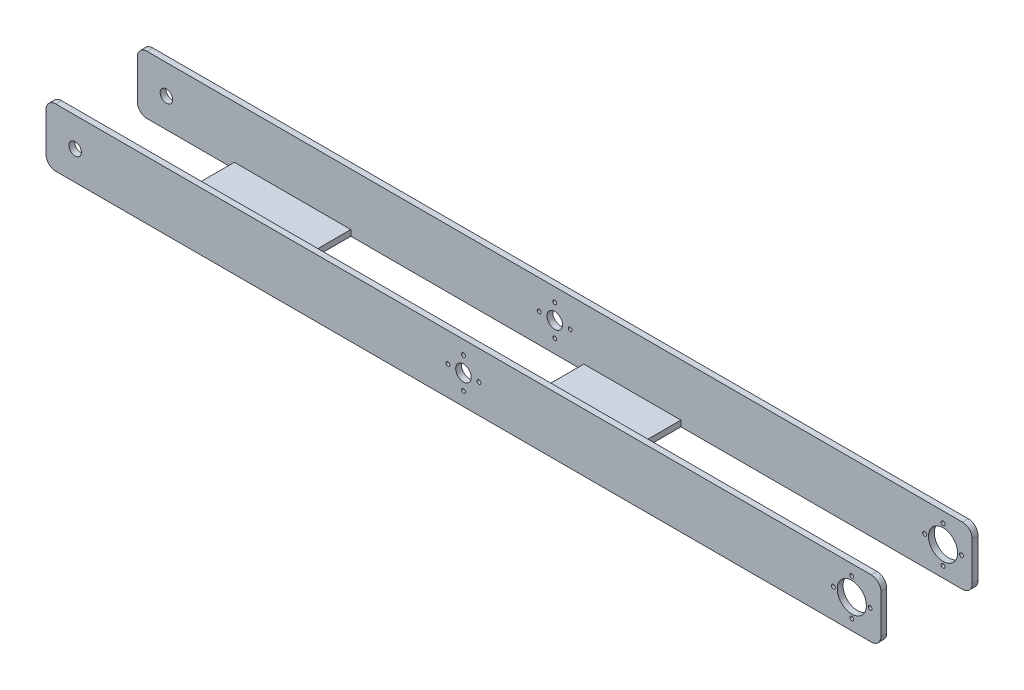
ISO-10303-21;
HEADER;
FILE_DESCRIPTION(('STEP AP214'),'2;1');
FILE_NAME('part.step','',(''),(''),'','','');
FILE_SCHEMA(('AUTOMOTIVE_DESIGN { 1 0 10303 214 1 1 1 1 }'));
ENDSEC;
DATA;
#1=APPLICATION_CONTEXT('core data for automotive mechanical design processes');
#2=APPLICATION_PROTOCOL_DEFINITION('international standard','automotive_design',2000,#1);
#3=PRODUCT_CONTEXT('',#1,'mechanical');
#4=PRODUCT('Part','Part','',(#3));
#5=PRODUCT_RELATED_PRODUCT_CATEGORY('part','',(#4));
#6=PRODUCT_DEFINITION_FORMATION('','',#4);
#7=PRODUCT_DEFINITION_CONTEXT('part definition',#1,'design');
#8=PRODUCT_DEFINITION('design','',#6,#7);
#9=PRODUCT_DEFINITION_SHAPE('','',#8);
#10=(LENGTH_UNIT() NAMED_UNIT(*) SI_UNIT(.MILLI.,.METRE.));
#11=(NAMED_UNIT(*) PLANE_ANGLE_UNIT() SI_UNIT($,.RADIAN.));
#12=(NAMED_UNIT(*) SI_UNIT($,.STERADIAN.) SOLID_ANGLE_UNIT());
#13=UNCERTAINTY_MEASURE_WITH_UNIT(LENGTH_MEASURE(1.E-05),#10,'distance_accuracy_value','');
#14=(GEOMETRIC_REPRESENTATION_CONTEXT(3) GLOBAL_UNCERTAINTY_ASSIGNED_CONTEXT((#13)) GLOBAL_UNIT_ASSIGNED_CONTEXT((#10,
#11,#12)) REPRESENTATION_CONTEXT('',''));
#15=CARTESIAN_POINT('',(0.,0.,0.));
#16=DIRECTION('',(0.,0.,1.));
#17=DIRECTION('',(1.,0.,0.));
#18=AXIS2_PLACEMENT_3D('',#15,#16,#17);
#19=CARTESIAN_POINT('',(215.,-15.,50.));
#20=DIRECTION('',(-1.,0.,0.));
#21=DIRECTION('',(0.,0.,1.));
#22=AXIS2_PLACEMENT_3D('',#19,#20,#21);
#23=PLANE('',#22);
#24=DIRECTION('',(0.,1.,0.));
#25=VECTOR('',#24,1.);
#26=CARTESIAN_POINT('',(215.,-15.,50.));
#27=LINE('',#26,#25);
#28=CARTESIAN_POINT('',(215.,-10.,50.));
#29=VERTEX_POINT('',#28);
#30=CARTESIAN_POINT('',(215.,10.,50.));
#31=VERTEX_POINT('',#30);
#32=EDGE_CURVE('E267',#29,#31,#27,.T.);
#33=ORIENTED_EDGE('',*,*,#32,.F.);
#34=DIRECTION('',(0.,0.,-1.));
#35=VECTOR('',#34,1.);
#36=CARTESIAN_POINT('',(215.,-10.,50.));
#37=LINE('',#36,#35);
#38=CARTESIAN_POINT('',(215.,-10.,47.));
#39=VERTEX_POINT('',#38);
#40=EDGE_CURVE('E392',#29,#39,#37,.T.);
#41=ORIENTED_EDGE('',*,*,#40,.T.);
#42=DIRECTION('',(0.,1.,0.));
#43=VECTOR('',#42,1.);
#44=CARTESIAN_POINT('',(215.,0.,47.));
#45=LINE('',#44,#43);
#46=CARTESIAN_POINT('',(215.,10.,47.));
#47=VERTEX_POINT('',#46);
#48=EDGE_CURVE('E264',#39,#47,#45,.T.);
#49=ORIENTED_EDGE('',*,*,#48,.T.);
#50=DIRECTION('',(0.,0.,-1.));
#51=VECTOR('',#50,1.);
#52=CARTESIAN_POINT('',(215.,10.,50.));
#53=LINE('',#52,#51);
#54=EDGE_CURVE('E390',#47,#31,#53,.F.);
#55=ORIENTED_EDGE('',*,*,#54,.T.);
#56=EDGE_LOOP('',(#33,#41,#49,#55));
#57=FACE_BOUND('',#56,.T.);
#58=ADVANCED_FACE('F43',(#57),#23,.F.);
#59=CARTESIAN_POINT('',(-215.,-15.,50.));
#60=DIRECTION('',(1.,0.,0.));
#61=DIRECTION('',(0.,0.,-1.));
#62=AXIS2_PLACEMENT_3D('',#59,#60,#61);
#63=PLANE('',#62);
#64=DIRECTION('',(0.,-1.,0.));
#65=VECTOR('',#64,1.);
#66=CARTESIAN_POINT('',(-215.,-15.,0.));
#67=LINE('',#66,#65);
#68=CARTESIAN_POINT('',(-215.,10.,0.));
#69=VERTEX_POINT('',#68);
#70=CARTESIAN_POINT('',(-215.,-10.,0.));
#71=VERTEX_POINT('',#70);
#72=EDGE_CURVE('E281',#69,#71,#67,.T.);
#73=ORIENTED_EDGE('',*,*,#72,.T.);
#74=DIRECTION('',(0.,0.,-1.));
#75=VECTOR('',#74,1.);
#76=CARTESIAN_POINT('',(-215.,-10.,50.));
#77=LINE('',#76,#75);
#78=CARTESIAN_POINT('',(-215.,-10.,3.));
#79=VERTEX_POINT('',#78);
#80=EDGE_CURVE('E351',#71,#79,#77,.F.);
#81=ORIENTED_EDGE('',*,*,#80,.T.);
#82=DIRECTION('',(0.,-1.,0.));
#83=VECTOR('',#82,1.);
#84=CARTESIAN_POINT('',(-215.,0.,3.));
#85=LINE('',#84,#83);
#86=CARTESIAN_POINT('',(-215.,10.,3.));
#87=VERTEX_POINT('',#86);
#88=EDGE_CURVE('E257',#87,#79,#85,.T.);
#89=ORIENTED_EDGE('',*,*,#88,.F.);
#90=DIRECTION('',(0.,0.,-1.));
#91=VECTOR('',#90,1.);
#92=CARTESIAN_POINT('',(-215.,10.,50.));
#93=LINE('',#92,#91);
#94=EDGE_CURVE('E348',#87,#69,#93,.T.);
#95=ORIENTED_EDGE('',*,*,#94,.T.);
#96=EDGE_LOOP('',(#73,#81,#89,#95));
#97=FACE_BOUND('',#96,.T.);
#98=ADVANCED_FACE('F423',(#97),#63,.F.);
#99=CARTESIAN_POINT('',(-215.,-12.,50.));
#100=DIRECTION('',(0.,1.,0.));
#101=DIRECTION('',(0.,0.,1.));
#102=AXIS2_PLACEMENT_3D('',#99,#100,#101);
#103=PLANE('',#102);
#104=DIRECTION('',(0.,0.,-1.));
#105=VECTOR('',#104,1.);
#106=CARTESIAN_POINT('',(15.,-12.,3.));
#107=LINE('',#106,#105);
#108=CARTESIAN_POINT('',(15.0000000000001,-12.,47.));
#109=VERTEX_POINT('',#108);
#110=CARTESIAN_POINT('',(15.0000000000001,-12.,3.));
#111=VERTEX_POINT('',#110);
#112=EDGE_CURVE('E457',#109,#111,#107,.T.);
#113=ORIENTED_EDGE('',*,*,#112,.F.);
#114=DIRECTION('',(1.,0.,0.));
#115=VECTOR('',#114,1.);
#116=CARTESIAN_POINT('',(0.,-12.,47.));
#117=LINE('',#116,#115);
#118=CARTESIAN_POINT('',(65.0000000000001,-12.,47.));
#119=VERTEX_POINT('',#118);
#120=EDGE_CURVE('E240',#109,#119,#117,.T.);
#121=ORIENTED_EDGE('',*,*,#120,.T.);
#122=DIRECTION('',(0.,0.,1.));
#123=VECTOR('',#122,1.);
#124=CARTESIAN_POINT('',(65.0000000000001,-12.,3.00000000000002));
#125=LINE('',#124,#123);
#126=CARTESIAN_POINT('',(65.0000000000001,-12.,3.00000000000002));
#127=VERTEX_POINT('',#126);
#128=EDGE_CURVE('E484',#127,#119,#125,.T.);
#129=ORIENTED_EDGE('',*,*,#128,.F.);
#130=DIRECTION('',(1.,0.,0.));
#131=VECTOR('',#130,1.);
#132=CARTESIAN_POINT('',(0.,-12.,3.));
#133=LINE('',#132,#131);
#134=EDGE_CURVE('E249',#111,#127,#133,.T.);
#135=ORIENTED_EDGE('',*,*,#134,.F.);
#136=EDGE_LOOP('',(#113,#121,#129,#135));
#137=FACE_BOUND('',#136,.T.);
#138=ADVANCED_FACE('F493',(#137),#103,.T.);
#139=DIRECTION('',(0.,1.,0.));
#140=VECTOR('',#139,1.);
#141=CARTESIAN_POINT('',(215.,0.,3.));
#142=LINE('',#141,#140);
#143=CARTESIAN_POINT('',(215.,-10.,3.));
#144=VERTEX_POINT('',#143);
#145=CARTESIAN_POINT('',(215.,10.,3.));
#146=VERTEX_POINT('',#145);
#147=EDGE_CURVE('E251',#144,#146,#142,.T.);
#148=ORIENTED_EDGE('',*,*,#147,.F.);
#149=DIRECTION('',(0.,0.,-1.));
#150=VECTOR('',#149,1.);
#151=CARTESIAN_POINT('',(215.,-10.,50.));
#152=LINE('',#151,#150);
#153=CARTESIAN_POINT('',(215.,-10.,0.));
#154=VERTEX_POINT('',#153);
#155=EDGE_CURVE('E11',#144,#154,#152,.T.);
#156=ORIENTED_EDGE('',*,*,#155,.T.);
#157=DIRECTION('',(0.,1.,0.));
#158=VECTOR('',#157,1.);
#159=CARTESIAN_POINT('',(215.,-15.,0.));
#160=LINE('',#159,#158);
#161=CARTESIAN_POINT('',(215.,10.,0.));
#162=VERTEX_POINT('',#161);
#163=EDGE_CURVE('E239',#154,#162,#160,.T.);
#164=ORIENTED_EDGE('',*,*,#163,.T.);
#165=DIRECTION('',(0.,0.,-1.));
#166=VECTOR('',#165,1.);
#167=CARTESIAN_POINT('',(215.,10.,50.));
#168=LINE('',#167,#166);
#169=EDGE_CURVE('E51',#162,#146,#168,.F.);
#170=ORIENTED_EDGE('',*,*,#169,.T.);
#171=EDGE_LOOP('',(#148,#156,#164,#170));
#172=FACE_BOUND('',#171,.T.);
#173=ADVANCED_FACE('F397',(#172),#23,.F.);
#174=CARTESIAN_POINT('',(-215.,15.,50.));
#175=DIRECTION('',(0.,-1.,0.));
#176=DIRECTION('',(0.,0.,-1.));
#177=AXIS2_PLACEMENT_3D('',#174,#175,#176);
#178=PLANE('',#177);
#179=DIRECTION('',(-1.,0.,0.));
#180=VECTOR('',#179,1.);
#181=CARTESIAN_POINT('',(-215.,15.,0.));
#182=LINE('',#181,#180);
#183=CARTESIAN_POINT('',(210.,15.,0.));
#184=VERTEX_POINT('',#183);
#185=CARTESIAN_POINT('',(-210.,15.,0.));
#186=VERTEX_POINT('',#185);
#187=EDGE_CURVE('E243',#184,#186,#182,.T.);
#188=ORIENTED_EDGE('',*,*,#187,.T.);
#189=DIRECTION('',(0.,0.,-1.));
#190=VECTOR('',#189,1.);
#191=CARTESIAN_POINT('',(-210.,15.,50.));
#192=LINE('',#191,#190);
#193=CARTESIAN_POINT('',(-210.,15.,3.));
#194=VERTEX_POINT('',#193);
#195=EDGE_CURVE('E364',#186,#194,#192,.F.);
#196=ORIENTED_EDGE('',*,*,#195,.T.);
#197=DIRECTION('',(-1.,0.,0.));
#198=VECTOR('',#197,1.);
#199=CARTESIAN_POINT('',(0.,15.,3.));
#200=LINE('',#199,#198);
#201=CARTESIAN_POINT('',(210.,15.,3.));
#202=VERTEX_POINT('',#201);
#203=EDGE_CURVE('E254',#202,#194,#200,.T.);
#204=ORIENTED_EDGE('',*,*,#203,.F.);
#205=DIRECTION('',(0.,0.,-1.));
#206=VECTOR('',#205,1.);
#207=CARTESIAN_POINT('',(210.,15.,50.));
#208=LINE('',#207,#206);
#209=EDGE_CURVE('E361',#202,#184,#208,.T.);
#210=ORIENTED_EDGE('',*,*,#209,.T.);
#211=EDGE_LOOP('',(#188,#196,#204,#210));
#212=FACE_BOUND('',#211,.T.);
#213=ADVANCED_FACE('F411',(#212),#178,.F.);
#214=DIRECTION('',(0.,-1.,0.));
#215=VECTOR('',#214,1.);
#216=CARTESIAN_POINT('',(-215.,0.,47.));
#217=LINE('',#216,#215);
#218=CARTESIAN_POINT('',(-215.,10.,47.));
#219=VERTEX_POINT('',#218);
#220=CARTESIAN_POINT('',(-215.,-10.,47.));
#221=VERTEX_POINT('',#220);
#222=EDGE_CURVE('E246',#219,#221,#217,.T.);
#223=ORIENTED_EDGE('',*,*,#222,.T.);
#224=DIRECTION('',(0.,0.,-1.));
#225=VECTOR('',#224,1.);
#226=CARTESIAN_POINT('',(-215.,-10.,50.));
#227=LINE('',#226,#225);
#228=CARTESIAN_POINT('',(-215.,-10.,50.));
#229=VERTEX_POINT('',#228);
#230=EDGE_CURVE('E377',#221,#229,#227,.F.);
#231=ORIENTED_EDGE('',*,*,#230,.T.);
#232=DIRECTION('',(0.,-1.,0.));
#233=VECTOR('',#232,1.);
#234=CARTESIAN_POINT('',(-215.,-15.,50.));
#235=LINE('',#234,#233);
#236=CARTESIAN_POINT('',(-215.,10.,50.));
#237=VERTEX_POINT('',#236);
#238=EDGE_CURVE('E272',#237,#229,#235,.T.);
#239=ORIENTED_EDGE('',*,*,#238,.F.);
#240=DIRECTION('',(0.,0.,-1.));
#241=VECTOR('',#240,1.);
#242=CARTESIAN_POINT('',(-215.,10.,50.));
#243=LINE('',#242,#241);
#244=EDGE_CURVE('E374',#237,#219,#243,.T.);
#245=ORIENTED_EDGE('',*,*,#244,.T.);
#246=EDGE_LOOP('',(#223,#231,#239,#245));
#247=FACE_BOUND('',#246,.T.);
#248=ADVANCED_FACE('F619',(#247),#63,.F.);
#249=DIRECTION('',(-1.,0.,0.));
#250=VECTOR('',#249,1.);
#251=CARTESIAN_POINT('',(0.,15.,47.));
#252=LINE('',#251,#250);
#253=CARTESIAN_POINT('',(210.,15.,47.));
#254=VERTEX_POINT('',#253);
#255=CARTESIAN_POINT('',(-210.,15.,47.));
#256=VERTEX_POINT('',#255);
#257=EDGE_CURVE('E262',#254,#256,#252,.T.);
#258=ORIENTED_EDGE('',*,*,#257,.T.);
#259=DIRECTION('',(0.,0.,-1.));
#260=VECTOR('',#259,1.);
#261=CARTESIAN_POINT('',(-210.,15.,50.));
#262=LINE('',#261,#260);
#263=CARTESIAN_POINT('',(-210.,15.,50.));
#264=VERTEX_POINT('',#263);
#265=EDGE_CURVE('E58',#256,#264,#262,.F.);
#266=ORIENTED_EDGE('',*,*,#265,.T.);
#267=DIRECTION('',(-1.,0.,0.));
#268=VECTOR('',#267,1.);
#269=CARTESIAN_POINT('',(-215.,15.,50.));
#270=LINE('',#269,#268);
#271=CARTESIAN_POINT('',(210.,15.,50.));
#272=VERTEX_POINT('',#271);
#273=EDGE_CURVE('E269',#272,#264,#270,.T.);
#274=ORIENTED_EDGE('',*,*,#273,.F.);
#275=DIRECTION('',(0.,0.,-1.));
#276=VECTOR('',#275,1.);
#277=CARTESIAN_POINT('',(210.,15.,50.));
#278=LINE('',#277,#276);
#279=EDGE_CURVE('E386',#272,#254,#278,.T.);
#280=ORIENTED_EDGE('',*,*,#279,.T.);
#281=EDGE_LOOP('',(#258,#266,#274,#280));
#282=FACE_BOUND('',#281,.T.);
#283=ADVANCED_FACE('F628',(#282),#178,.F.);
#284=CARTESIAN_POINT('',(-215.,-15.,50.));
#285=DIRECTION('',(0.,1.,0.));
#286=DIRECTION('',(0.,0.,1.));
#287=AXIS2_PLACEMENT_3D('',#284,#285,#286);
#288=PLANE('',#287);
#289=DIRECTION('',(-1.,0.,0.));
#290=VECTOR('',#289,1.);
#291=CARTESIAN_POINT('',(15.0000000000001,-15.,47.2319870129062));
#292=LINE('',#291,#290);
#293=CARTESIAN_POINT('',(15.0000000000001,-15.,47.2319870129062));
#294=VERTEX_POINT('',#293);
#295=CARTESIAN_POINT('',(-105.,-15.,47.2319870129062));
#296=VERTEX_POINT('',#295);
#297=EDGE_CURVE('E444',#294,#296,#292,.T.);
#298=ORIENTED_EDGE('',*,*,#297,.F.);
#299=DIRECTION('',(0.,0.,1.));
#300=VECTOR('',#299,1.);
#301=CARTESIAN_POINT('',(15.,-15.,3.));
#302=LINE('',#301,#300);
#303=CARTESIAN_POINT('',(15.,-15.,3.));
#304=VERTEX_POINT('',#303);
#305=EDGE_CURVE('E454',#304,#294,#302,.T.);
#306=ORIENTED_EDGE('',*,*,#305,.F.);
#307=DIRECTION('',(1.,0.,0.));
#308=VECTOR('',#307,1.);
#309=CARTESIAN_POINT('',(15.,-15.,3.));
#310=LINE('',#309,#308);
#311=CARTESIAN_POINT('',(-105.,-15.,3.));
#312=VERTEX_POINT('',#311);
#313=EDGE_CURVE('E471',#312,#304,#310,.T.);
#314=ORIENTED_EDGE('',*,*,#313,.F.);
#315=DIRECTION('',(0.,0.,-1.));
#316=VECTOR('',#315,1.);
#317=CARTESIAN_POINT('',(-105.,-15.,3.));
#318=LINE('',#317,#316);
#319=EDGE_CURVE('E441',#296,#312,#318,.T.);
#320=ORIENTED_EDGE('',*,*,#319,.F.);
#321=EDGE_LOOP('',(#298,#306,#314,#320));
#322=FACE_BOUND('',#321,.T.);
#323=DIRECTION('',(1.,0.,0.));
#324=VECTOR('',#323,1.);
#325=CARTESIAN_POINT('',(-215.,-15.,3.));
#326=LINE('',#325,#324);
#327=CARTESIAN_POINT('',(-210.,-15.,3.));
#328=VERTEX_POINT('',#327);
#329=CARTESIAN_POINT('',(-165.,-15.,3.));
#330=VERTEX_POINT('',#329);
#331=EDGE_CURVE('E233',#328,#330,#326,.T.);
#332=ORIENTED_EDGE('',*,*,#331,.F.);
#333=DIRECTION('',(0.,0.,-1.));
#334=VECTOR('',#333,1.);
#335=CARTESIAN_POINT('',(-210.,-15.,50.));
#336=LINE('',#335,#334);
#337=CARTESIAN_POINT('',(-210.,-15.,0.));
#338=VERTEX_POINT('',#337);
#339=EDGE_CURVE('E337',#328,#338,#336,.T.);
#340=ORIENTED_EDGE('',*,*,#339,.T.);
#341=DIRECTION('',(1.,0.,0.));
#342=VECTOR('',#341,1.);
#343=CARTESIAN_POINT('',(-215.,-15.,0.));
#344=LINE('',#343,#342);
#345=CARTESIAN_POINT('',(210.,-15.,0.));
#346=VERTEX_POINT('',#345);
#347=EDGE_CURVE('E270',#338,#346,#344,.T.);
#348=ORIENTED_EDGE('',*,*,#347,.T.);
#349=DIRECTION('',(0.,0.,-1.));
#350=VECTOR('',#349,1.);
#351=CARTESIAN_POINT('',(210.,-15.,50.));
#352=LINE('',#351,#350);
#353=CARTESIAN_POINT('',(210.,-15.,3.));
#354=VERTEX_POINT('',#353);
#355=EDGE_CURVE('E277',#346,#354,#352,.F.);
#356=ORIENTED_EDGE('',*,*,#355,.T.);
#357=DIRECTION('',(1.,0.,0.));
#358=VECTOR('',#357,1.);
#359=CARTESIAN_POINT('',(215.,-15.,3.));
#360=LINE('',#359,#358);
#361=CARTESIAN_POINT('',(65.0000000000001,-15.,3.00000000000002));
#362=VERTEX_POINT('',#361);
#363=EDGE_CURVE('E437',#362,#354,#360,.T.);
#364=ORIENTED_EDGE('',*,*,#363,.F.);
#365=DIRECTION('',(0.,0.,-1.));
#366=VECTOR('',#365,1.);
#367=CARTESIAN_POINT('',(65.0000000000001,-15.,3.00000000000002));
#368=LINE('',#367,#366);
#369=CARTESIAN_POINT('',(65.0000000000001,-15.,47.));
#370=VERTEX_POINT('',#369);
#371=EDGE_CURVE('E480',#370,#362,#368,.T.);
#372=ORIENTED_EDGE('',*,*,#371,.F.);
#373=DIRECTION('',(-1.,0.,0.));
#374=VECTOR('',#373,1.);
#375=CARTESIAN_POINT('',(215.,-15.,47.));
#376=LINE('',#375,#374);
#377=CARTESIAN_POINT('',(210.,-15.,47.));
#378=VERTEX_POINT('',#377);
#379=EDGE_CURVE('E482',#378,#370,#376,.T.);
#380=ORIENTED_EDGE('',*,*,#379,.F.);
#381=DIRECTION('',(0.,0.,-1.));
#382=VECTOR('',#381,1.);
#383=CARTESIAN_POINT('',(210.,-15.,50.));
#384=LINE('',#383,#382);
#385=CARTESIAN_POINT('',(210.,-15.,50.));
#386=VERTEX_POINT('',#385);
#387=EDGE_CURVE('E332',#378,#386,#384,.F.);
#388=ORIENTED_EDGE('',*,*,#387,.T.);
#389=DIRECTION('',(1.,0.,0.));
#390=VECTOR('',#389,1.);
#391=CARTESIAN_POINT('',(-215.,-15.,50.));
#392=LINE('',#391,#390);
#393=CARTESIAN_POINT('',(-210.,-15.,50.));
#394=VERTEX_POINT('',#393);
#395=EDGE_CURVE('E275',#394,#386,#392,.T.);
#396=ORIENTED_EDGE('',*,*,#395,.F.);
#397=DIRECTION('',(0.,0.,-1.));
#398=VECTOR('',#397,1.);
#399=CARTESIAN_POINT('',(-210.,-15.,50.));
#400=LINE('',#399,#398);
#401=CARTESIAN_POINT('',(-210.,-15.,47.));
#402=VERTEX_POINT('',#401);
#403=EDGE_CURVE('E334',#394,#402,#400,.T.);
#404=ORIENTED_EDGE('',*,*,#403,.T.);
#405=DIRECTION('',(-1.,0.,0.));
#406=VECTOR('',#405,1.);
#407=CARTESIAN_POINT('',(-215.,-15.,47.));
#408=LINE('',#407,#406);
#409=CARTESIAN_POINT('',(-165.,-15.,47.));
#410=VERTEX_POINT('',#409);
#411=EDGE_CURVE('E448',#410,#402,#408,.T.);
#412=ORIENTED_EDGE('',*,*,#411,.F.);
#413=DIRECTION('',(0.,0.,1.));
#414=VECTOR('',#413,1.);
#415=CARTESIAN_POINT('',(-165.,-15.,3.));
#416=LINE('',#415,#414);
#417=EDGE_CURVE('E218',#330,#410,#416,.T.);
#418=ORIENTED_EDGE('',*,*,#417,.F.);
#419=EDGE_LOOP('',(#332,#340,#348,#356,#364,#372,#380,#388,#396,#404,#412,#418));
#420=FACE_BOUND('',#419,.T.);
#421=ADVANCED_FACE('F431',(#322,#420),#288,.F.);
#422=CARTESIAN_POINT('',(0.,0.,50.));
#423=DIRECTION('',(0.,0.,-1.));
#424=DIRECTION('',(-1.,0.,0.));
#425=AXIS2_PLACEMENT_3D('',#422,#423,#424);
#426=PLANE('',#425);
#427=CARTESIAN_POINT('',(8.,0.,50.));
#428=DIRECTION('',(0.,0.,-1.));
#429=DIRECTION('',(-1.,0.,0.));
#430=AXIS2_PLACEMENT_3D('',#427,#428,#429);
#431=CIRCLE('',#430,1.);
#432=CARTESIAN_POINT('',(7.,0.,50.));
#433=VERTEX_POINT('',#432);
#434=EDGE_CURVE('E568',#433,#433,#431,.T.);
#435=ORIENTED_EDGE('',*,*,#434,.T.);
#436=EDGE_LOOP('',(#435));
#437=FACE_BOUND('',#436,.T.);
#438=CARTESIAN_POINT('',(-8.,0.,50.));
#439=DIRECTION('',(0.,0.,-1.));
#440=DIRECTION('',(-1.,0.,0.));
#441=AXIS2_PLACEMENT_3D('',#438,#439,#440);
#442=CIRCLE('',#441,1.);
#443=CARTESIAN_POINT('',(-9.,0.,50.));
#444=VERTEX_POINT('',#443);
#445=EDGE_CURVE('E558',#444,#444,#442,.T.);
#446=ORIENTED_EDGE('',*,*,#445,.T.);
#447=EDGE_LOOP('',(#446));
#448=FACE_BOUND('',#447,.T.);
#449=CARTESIAN_POINT('',(0.,-8.,50.));
#450=DIRECTION('',(0.,0.,-1.));
#451=DIRECTION('',(-1.,0.,0.));
#452=AXIS2_PLACEMENT_3D('',#449,#450,#451);
#453=CIRCLE('',#452,1.);
#454=CARTESIAN_POINT('',(-1.,-8.,50.));
#455=VERTEX_POINT('',#454);
#456=EDGE_CURVE('E557',#455,#455,#453,.T.);
#457=ORIENTED_EDGE('',*,*,#456,.T.);
#458=EDGE_LOOP('',(#457));
#459=FACE_BOUND('',#458,.T.);
#460=CARTESIAN_POINT('',(0.,8.,50.));
#461=DIRECTION('',(0.,0.,-1.));
#462=DIRECTION('',(-1.,0.,0.));
#463=AXIS2_PLACEMENT_3D('',#460,#461,#462);
#464=CIRCLE('',#463,1.);
#465=CARTESIAN_POINT('',(-1.,8.,50.));
#466=VERTEX_POINT('',#465);
#467=EDGE_CURVE('E525',#466,#466,#464,.T.);
#468=ORIENTED_EDGE('',*,*,#467,.T.);
#469=EDGE_LOOP('',(#468));
#470=FACE_BOUND('',#469,.T.);
#471=CARTESIAN_POINT('',(209.5,0.,50.));
#472=DIRECTION('',(0.,0.,-1.));
#473=DIRECTION('',(-1.,0.,0.));
#474=AXIS2_PLACEMENT_3D('',#471,#472,#473);
#475=CIRCLE('',#474,0.999999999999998);
#476=CARTESIAN_POINT('',(208.5,0.,50.));
#477=VERTEX_POINT('',#476);
#478=EDGE_CURVE('E545',#477,#477,#475,.T.);
#479=ORIENTED_EDGE('',*,*,#478,.T.);
#480=EDGE_LOOP('',(#479));
#481=FACE_BOUND('',#480,.T.);
#482=CARTESIAN_POINT('',(200.,-9.50000000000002,50.));
#483=DIRECTION('',(0.,0.,-1.));
#484=DIRECTION('',(-1.,0.,0.));
#485=AXIS2_PLACEMENT_3D('',#482,#483,#484);
#486=CIRCLE('',#485,0.999999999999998);
#487=CARTESIAN_POINT('',(199.,-9.50000000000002,50.));
#488=VERTEX_POINT('',#487);
#489=EDGE_CURVE('E532',#488,#488,#486,.T.);
#490=ORIENTED_EDGE('',*,*,#489,.T.);
#491=EDGE_LOOP('',(#490));
#492=FACE_BOUND('',#491,.T.);
#493=CARTESIAN_POINT('',(190.5,0.,50.));
#494=DIRECTION('',(0.,0.,-1.));
#495=DIRECTION('',(-1.,0.,0.));
#496=AXIS2_PLACEMENT_3D('',#493,#494,#495);
#497=CIRCLE('',#496,0.999999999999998);
#498=CARTESIAN_POINT('',(189.5,0.,50.));
#499=VERTEX_POINT('',#498);
#500=EDGE_CURVE('E531',#499,#499,#497,.T.);
#501=ORIENTED_EDGE('',*,*,#500,.T.);
#502=EDGE_LOOP('',(#501));
#503=FACE_BOUND('',#502,.T.);
#504=CARTESIAN_POINT('',(200.,9.49999999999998,50.));
#505=DIRECTION('',(0.,0.,-1.));
#506=DIRECTION('',(-1.,0.,0.));
#507=AXIS2_PLACEMENT_3D('',#504,#505,#506);
#508=CIRCLE('',#507,0.999999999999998);
#509=CARTESIAN_POINT('',(199.,9.49999999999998,50.));
#510=VERTEX_POINT('',#509);
#511=EDGE_CURVE('E538',#510,#510,#508,.T.);
#512=ORIENTED_EDGE('',*,*,#511,.T.);
#513=EDGE_LOOP('',(#512));
#514=FACE_BOUND('',#513,.T.);
#515=CARTESIAN_POINT('',(-200.,0.,50.));
#516=DIRECTION('',(0.,0.,-1.));
#517=DIRECTION('',(-1.,0.,0.));
#518=AXIS2_PLACEMENT_3D('',#515,#516,#517);
#519=CIRCLE('',#518,3.20000000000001);
#520=CARTESIAN_POINT('',(-203.2,0.,50.));
#521=VERTEX_POINT('',#520);
#522=EDGE_CURVE('E546',#521,#521,#519,.T.);
#523=ORIENTED_EDGE('',*,*,#522,.T.);
#524=EDGE_LOOP('',(#523));
#525=FACE_BOUND('',#524,.T.);
#526=CARTESIAN_POINT('',(200.,0.,50.));
#527=DIRECTION('',(0.,0.,-1.));
#528=DIRECTION('',(-1.,0.,0.));
#529=AXIS2_PLACEMENT_3D('',#526,#527,#528);
#530=CIRCLE('',#529,7.50000000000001);
#531=CARTESIAN_POINT('',(192.5,0.,50.));
#532=VERTEX_POINT('',#531);
#533=EDGE_CURVE('E579',#532,#532,#530,.T.);
#534=ORIENTED_EDGE('',*,*,#533,.T.);
#535=EDGE_LOOP('',(#534));
#536=FACE_BOUND('',#535,.T.);
#537=CARTESIAN_POINT('',(0.,0.,50.));
#538=DIRECTION('',(0.,0.,-1.));
#539=DIRECTION('',(-1.,0.,0.));
#540=AXIS2_PLACEMENT_3D('',#537,#538,#539);
#541=CIRCLE('',#540,4.);
#542=CARTESIAN_POINT('',(-4.,0.,50.));
#543=VERTEX_POINT('',#542);
#544=EDGE_CURVE('E290',#543,#543,#541,.T.);
#545=ORIENTED_EDGE('',*,*,#544,.T.);
#546=EDGE_LOOP('',(#545));
#547=FACE_BOUND('',#546,.T.);
#548=ORIENTED_EDGE('',*,*,#238,.T.);
#549=CARTESIAN_POINT('',(-210.,-10.,50.));
#550=DIRECTION('',(0.,0.,-1.));
#551=DIRECTION('',(-1.,0.,0.));
#552=AXIS2_PLACEMENT_3D('',#549,#550,#551);
#553=CIRCLE('',#552,5.);
#554=EDGE_CURVE('E384',#229,#394,#553,.F.);
#555=ORIENTED_EDGE('',*,*,#554,.T.);
#556=ORIENTED_EDGE('',*,*,#395,.T.);
#557=CARTESIAN_POINT('',(210.,-10.,50.));
#558=DIRECTION('',(0.,0.,-1.));
#559=DIRECTION('',(-1.,0.,0.));
#560=AXIS2_PLACEMENT_3D('',#557,#558,#559);
#561=CIRCLE('',#560,5.);
#562=EDGE_CURVE('E380',#386,#29,#561,.F.);
#563=ORIENTED_EDGE('',*,*,#562,.T.);
#564=ORIENTED_EDGE('',*,*,#32,.T.);
#565=CARTESIAN_POINT('',(210.,10.,50.));
#566=DIRECTION('',(0.,0.,-1.));
#567=DIRECTION('',(-1.,0.,0.));
#568=AXIS2_PLACEMENT_3D('',#565,#566,#567);
#569=CIRCLE('',#568,5.);
#570=EDGE_CURVE('E65',#31,#272,#569,.F.);
#571=ORIENTED_EDGE('',*,*,#570,.T.);
#572=ORIENTED_EDGE('',*,*,#273,.T.);
#573=CARTESIAN_POINT('',(-210.,10.,50.));
#574=DIRECTION('',(0.,0.,-1.));
#575=DIRECTION('',(-1.,0.,0.));
#576=AXIS2_PLACEMENT_3D('',#573,#574,#575);
#577=CIRCLE('',#576,5.);
#578=EDGE_CURVE('E382',#264,#237,#577,.F.);
#579=ORIENTED_EDGE('',*,*,#578,.T.);
#580=EDGE_LOOP('',(#548,#555,#556,#563,#564,#571,#572,#579));
#581=FACE_BOUND('',#580,.T.);
#582=ADVANCED_FACE('F588',(#437,#448,#459,#470,#481,#492,#503,#514,#525,#536,#547,#581),#426,.F.);
#583=CARTESIAN_POINT('',(0.,0.,0.));
#584=DIRECTION('',(0.,0.,-1.));
#585=DIRECTION('',(-1.,0.,0.));
#586=AXIS2_PLACEMENT_3D('',#583,#584,#585);
#587=PLANE('',#586);
#588=CARTESIAN_POINT('',(8.,0.,0.));
#589=DIRECTION('',(0.,0.,-1.));
#590=DIRECTION('',(-1.,0.,0.));
#591=AXIS2_PLACEMENT_3D('',#588,#589,#590);
#592=CIRCLE('',#591,1.);
#593=CARTESIAN_POINT('',(7.,0.,0.));
#594=VERTEX_POINT('',#593);
#595=EDGE_CURVE('E541',#594,#594,#592,.T.);
#596=ORIENTED_EDGE('',*,*,#595,.F.);
#597=EDGE_LOOP('',(#596));
#598=FACE_BOUND('',#597,.T.);
#599=CARTESIAN_POINT('',(-8.,0.,0.));
#600=DIRECTION('',(0.,0.,-1.));
#601=DIRECTION('',(-1.,0.,0.));
#602=AXIS2_PLACEMENT_3D('',#599,#600,#601);
#603=CIRCLE('',#602,1.);
#604=CARTESIAN_POINT('',(-9.,0.,0.));
#605=VERTEX_POINT('',#604);
#606=EDGE_CURVE('E571',#605,#605,#603,.T.);
#607=ORIENTED_EDGE('',*,*,#606,.F.);
#608=EDGE_LOOP('',(#607));
#609=FACE_BOUND('',#608,.T.);
#610=CARTESIAN_POINT('',(0.,-8.,0.));
#611=DIRECTION('',(0.,0.,-1.));
#612=DIRECTION('',(-1.,0.,0.));
#613=AXIS2_PLACEMENT_3D('',#610,#611,#612);
#614=CIRCLE('',#613,1.);
#615=CARTESIAN_POINT('',(-1.,-8.,0.));
#616=VERTEX_POINT('',#615);
#617=EDGE_CURVE('E554',#616,#616,#614,.T.);
#618=ORIENTED_EDGE('',*,*,#617,.F.);
#619=EDGE_LOOP('',(#618));
#620=FACE_BOUND('',#619,.T.);
#621=CARTESIAN_POINT('',(0.,8.,0.));
#622=DIRECTION('',(0.,0.,-1.));
#623=DIRECTION('',(-1.,0.,0.));
#624=AXIS2_PLACEMENT_3D('',#621,#622,#623);
#625=CIRCLE('',#624,1.);
#626=CARTESIAN_POINT('',(-1.,8.,0.));
#627=VERTEX_POINT('',#626);
#628=EDGE_CURVE('E561',#627,#627,#625,.T.);
#629=ORIENTED_EDGE('',*,*,#628,.F.);
#630=EDGE_LOOP('',(#629));
#631=FACE_BOUND('',#630,.T.);
#632=CARTESIAN_POINT('',(209.5,0.,0.));
#633=DIRECTION('',(0.,0.,-1.));
#634=DIRECTION('',(-1.,0.,0.));
#635=AXIS2_PLACEMENT_3D('',#632,#633,#634);
#636=CIRCLE('',#635,0.999999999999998);
#637=CARTESIAN_POINT('',(208.5,0.,0.));
#638=VERTEX_POINT('',#637);
#639=EDGE_CURVE('E542',#638,#638,#636,.T.);
#640=ORIENTED_EDGE('',*,*,#639,.F.);
#641=EDGE_LOOP('',(#640));
#642=FACE_BOUND('',#641,.T.);
#643=CARTESIAN_POINT('',(200.,-9.50000000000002,0.));
#644=DIRECTION('',(0.,0.,-1.));
#645=DIRECTION('',(-1.,0.,0.));
#646=AXIS2_PLACEMENT_3D('',#643,#644,#645);
#647=CIRCLE('',#646,0.999999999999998);
#648=CARTESIAN_POINT('',(199.,-9.50000000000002,0.));
#649=VERTEX_POINT('',#648);
#650=EDGE_CURVE('E549',#649,#649,#647,.T.);
#651=ORIENTED_EDGE('',*,*,#650,.F.);
#652=EDGE_LOOP('',(#651));
#653=FACE_BOUND('',#652,.T.);
#654=CARTESIAN_POINT('',(190.5,0.,0.));
#655=DIRECTION('',(0.,0.,-1.));
#656=DIRECTION('',(-1.,0.,0.));
#657=AXIS2_PLACEMENT_3D('',#654,#655,#656);
#658=CIRCLE('',#657,0.999999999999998);
#659=CARTESIAN_POINT('',(189.5,0.,0.));
#660=VERTEX_POINT('',#659);
#661=EDGE_CURVE('E528',#660,#660,#658,.T.);
#662=ORIENTED_EDGE('',*,*,#661,.F.);
#663=EDGE_LOOP('',(#662));
#664=FACE_BOUND('',#663,.T.);
#665=CARTESIAN_POINT('',(200.,9.49999999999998,0.));
#666=DIRECTION('',(0.,0.,-1.));
#667=DIRECTION('',(-1.,0.,0.));
#668=AXIS2_PLACEMENT_3D('',#665,#666,#667);
#669=CIRCLE('',#668,0.999999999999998);
#670=CARTESIAN_POINT('',(199.,9.49999999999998,0.));
#671=VERTEX_POINT('',#670);
#672=EDGE_CURVE('E535',#671,#671,#669,.T.);
#673=ORIENTED_EDGE('',*,*,#672,.F.);
#674=EDGE_LOOP('',(#673));
#675=FACE_BOUND('',#674,.T.);
#676=CARTESIAN_POINT('',(-200.,0.,0.));
#677=DIRECTION('',(0.,0.,-1.));
#678=DIRECTION('',(-1.,0.,0.));
#679=AXIS2_PLACEMENT_3D('',#676,#677,#678);
#680=CIRCLE('',#679,3.20000000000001);
#681=CARTESIAN_POINT('',(-203.2,0.,0.));
#682=VERTEX_POINT('',#681);
#683=EDGE_CURVE('E582',#682,#682,#680,.T.);
#684=ORIENTED_EDGE('',*,*,#683,.F.);
#685=EDGE_LOOP('',(#684));
#686=FACE_BOUND('',#685,.T.);
#687=CARTESIAN_POINT('',(200.,0.,0.));
#688=DIRECTION('',(0.,0.,-1.));
#689=DIRECTION('',(-1.,0.,0.));
#690=AXIS2_PLACEMENT_3D('',#687,#688,#689);
#691=CIRCLE('',#690,7.50000000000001);
#692=CARTESIAN_POINT('',(192.5,0.,0.));
#693=VERTEX_POINT('',#692);
#694=EDGE_CURVE('E576',#693,#693,#691,.T.);
#695=ORIENTED_EDGE('',*,*,#694,.F.);
#696=EDGE_LOOP('',(#695));
#697=FACE_BOUND('',#696,.T.);
#698=CARTESIAN_POINT('',(0.,0.,0.));
#699=DIRECTION('',(0.,0.,-1.));
#700=DIRECTION('',(-1.,0.,0.));
#701=AXIS2_PLACEMENT_3D('',#698,#699,#700);
#702=CIRCLE('',#701,4.);
#703=CARTESIAN_POINT('',(-4.,0.,0.));
#704=VERTEX_POINT('',#703);
#705=EDGE_CURVE('E522',#704,#704,#702,.T.);
#706=ORIENTED_EDGE('',*,*,#705,.F.);
#707=EDGE_LOOP('',(#706));
#708=FACE_BOUND('',#707,.T.);
#709=ORIENTED_EDGE('',*,*,#347,.F.);
#710=CARTESIAN_POINT('',(-210.,-10.,0.));
#711=DIRECTION('',(0.,0.,-1.));
#712=DIRECTION('',(-1.,0.,0.));
#713=AXIS2_PLACEMENT_3D('',#710,#711,#712);
#714=CIRCLE('',#713,5.);
#715=EDGE_CURVE('E346',#338,#71,#714,.T.);
#716=ORIENTED_EDGE('',*,*,#715,.T.);
#717=ORIENTED_EDGE('',*,*,#72,.F.);
#718=CARTESIAN_POINT('',(-210.,10.,0.));
#719=DIRECTION('',(0.,0.,-1.));
#720=DIRECTION('',(-1.,0.,0.));
#721=AXIS2_PLACEMENT_3D('',#718,#719,#720);
#722=CIRCLE('',#721,5.);
#723=EDGE_CURVE('E344',#69,#186,#722,.T.);
#724=ORIENTED_EDGE('',*,*,#723,.T.);
#725=ORIENTED_EDGE('',*,*,#187,.F.);
#726=CARTESIAN_POINT('',(210.,10.,0.));
#727=DIRECTION('',(0.,0.,-1.));
#728=DIRECTION('',(-1.,0.,0.));
#729=AXIS2_PLACEMENT_3D('',#726,#727,#728);
#730=CIRCLE('',#729,5.);
#731=EDGE_CURVE('E340',#184,#162,#730,.T.);
#732=ORIENTED_EDGE('',*,*,#731,.T.);
#733=ORIENTED_EDGE('',*,*,#163,.F.);
#734=CARTESIAN_POINT('',(210.,-10.,0.));
#735=DIRECTION('',(0.,0.,-1.));
#736=DIRECTION('',(-1.,0.,0.));
#737=AXIS2_PLACEMENT_3D('',#734,#735,#736);
#738=CIRCLE('',#737,5.);
#739=EDGE_CURVE('E342',#154,#346,#738,.T.);
#740=ORIENTED_EDGE('',*,*,#739,.T.);
#741=EDGE_LOOP('',(#709,#716,#717,#724,#725,#732,#733,#740));
#742=FACE_BOUND('',#741,.T.);
#743=ADVANCED_FACE('F415',(#598,#609,#620,#631,#642,#653,#664,#675,#686,#697,#708,#742),#587,.T.);
#744=DIRECTION('',(0.,0.,-1.));
#745=VECTOR('',#744,1.);
#746=CARTESIAN_POINT('',(-165.,-12.,3.));
#747=LINE('',#746,#745);
#748=CARTESIAN_POINT('',(-165.,-12.,47.));
#749=VERTEX_POINT('',#748);
#750=CARTESIAN_POINT('',(-165.,-12.,3.));
#751=VERTEX_POINT('',#750);
#752=EDGE_CURVE('E215',#749,#751,#747,.T.);
#753=ORIENTED_EDGE('',*,*,#752,.F.);
#754=CARTESIAN_POINT('',(-105.,-12.,47.));
#755=VERTEX_POINT('',#754);
#756=EDGE_CURVE('E230',#749,#755,#117,.T.);
#757=ORIENTED_EDGE('',*,*,#756,.T.);
#758=DIRECTION('',(0.,0.,1.));
#759=VECTOR('',#758,1.);
#760=CARTESIAN_POINT('',(-105.,-12.,3.));
#761=LINE('',#760,#759);
#762=CARTESIAN_POINT('',(-105.,-12.,3.));
#763=VERTEX_POINT('',#762);
#764=EDGE_CURVE('E462',#763,#755,#761,.T.);
#765=ORIENTED_EDGE('',*,*,#764,.F.);
#766=EDGE_CURVE('E232',#751,#763,#133,.T.);
#767=ORIENTED_EDGE('',*,*,#766,.F.);
#768=EDGE_LOOP('',(#753,#757,#765,#767));
#769=FACE_BOUND('',#768,.T.);
#770=ADVANCED_FACE('F228',(#769),#103,.T.);
#771=CARTESIAN_POINT('',(0.,0.,47.));
#772=DIRECTION('',(0.,0.,-1.));
#773=DIRECTION('',(-1.,0.,0.));
#774=AXIS2_PLACEMENT_3D('',#771,#772,#773);
#775=PLANE('',#774);
#776=CARTESIAN_POINT('',(8.,0.,47.));
#777=DIRECTION('',(0.,0.,-1.));
#778=DIRECTION('',(-1.,0.,0.));
#779=AXIS2_PLACEMENT_3D('',#776,#777,#778);
#780=CIRCLE('',#779,1.);
#781=CARTESIAN_POINT('',(7.,0.,47.));
#782=VERTEX_POINT('',#781);
#783=EDGE_CURVE('E330',#782,#782,#780,.T.);
#784=ORIENTED_EDGE('',*,*,#783,.F.);
#785=EDGE_LOOP('',(#784));
#786=FACE_BOUND('',#785,.T.);
#787=CARTESIAN_POINT('',(-8.,0.,47.));
#788=DIRECTION('',(0.,0.,-1.));
#789=DIRECTION('',(-1.,0.,0.));
#790=AXIS2_PLACEMENT_3D('',#787,#788,#789);
#791=CIRCLE('',#790,1.);
#792=CARTESIAN_POINT('',(-9.,0.,47.));
#793=VERTEX_POINT('',#792);
#794=EDGE_CURVE('E326',#793,#793,#791,.T.);
#795=ORIENTED_EDGE('',*,*,#794,.F.);
#796=EDGE_LOOP('',(#795));
#797=FACE_BOUND('',#796,.T.);
#798=CARTESIAN_POINT('',(0.,-8.,47.));
#799=DIRECTION('',(0.,0.,-1.));
#800=DIRECTION('',(-1.,0.,0.));
#801=AXIS2_PLACEMENT_3D('',#798,#799,#800);
#802=CIRCLE('',#801,1.);
#803=CARTESIAN_POINT('',(-1.,-8.,47.));
#804=VERTEX_POINT('',#803);
#805=EDGE_CURVE('E322',#804,#804,#802,.T.);
#806=ORIENTED_EDGE('',*,*,#805,.F.);
#807=EDGE_LOOP('',(#806));
#808=FACE_BOUND('',#807,.T.);
#809=CARTESIAN_POINT('',(0.,8.,47.));
#810=DIRECTION('',(0.,0.,-1.));
#811=DIRECTION('',(-1.,0.,0.));
#812=AXIS2_PLACEMENT_3D('',#809,#810,#811);
#813=CIRCLE('',#812,1.);
#814=CARTESIAN_POINT('',(-1.,8.,47.));
#815=VERTEX_POINT('',#814);
#816=EDGE_CURVE('E318',#815,#815,#813,.T.);
#817=ORIENTED_EDGE('',*,*,#816,.F.);
#818=EDGE_LOOP('',(#817));
#819=FACE_BOUND('',#818,.T.);
#820=CARTESIAN_POINT('',(209.5,0.,47.));
#821=DIRECTION('',(0.,0.,-1.));
#822=DIRECTION('',(-1.,0.,0.));
#823=AXIS2_PLACEMENT_3D('',#820,#821,#822);
#824=CIRCLE('',#823,0.999999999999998);
#825=CARTESIAN_POINT('',(208.5,0.,47.));
#826=VERTEX_POINT('',#825);
#827=EDGE_CURVE('E314',#826,#826,#824,.T.);
#828=ORIENTED_EDGE('',*,*,#827,.F.);
#829=EDGE_LOOP('',(#828));
#830=FACE_BOUND('',#829,.T.);
#831=CARTESIAN_POINT('',(200.,-9.50000000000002,47.));
#832=DIRECTION('',(0.,0.,-1.));
#833=DIRECTION('',(-1.,0.,0.));
#834=AXIS2_PLACEMENT_3D('',#831,#832,#833);
#835=CIRCLE('',#834,0.999999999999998);
#836=CARTESIAN_POINT('',(199.,-9.50000000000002,47.));
#837=VERTEX_POINT('',#836);
#838=EDGE_CURVE('E310',#837,#837,#835,.T.);
#839=ORIENTED_EDGE('',*,*,#838,.F.);
#840=EDGE_LOOP('',(#839));
#841=FACE_BOUND('',#840,.T.);
#842=CARTESIAN_POINT('',(190.5,0.,47.));
#843=DIRECTION('',(0.,0.,-1.));
#844=DIRECTION('',(-1.,0.,0.));
#845=AXIS2_PLACEMENT_3D('',#842,#843,#844);
#846=CIRCLE('',#845,0.999999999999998);
#847=CARTESIAN_POINT('',(189.5,0.,47.));
#848=VERTEX_POINT('',#847);
#849=EDGE_CURVE('E306',#848,#848,#846,.T.);
#850=ORIENTED_EDGE('',*,*,#849,.F.);
#851=EDGE_LOOP('',(#850));
#852=FACE_BOUND('',#851,.T.);
#853=CARTESIAN_POINT('',(200.,9.49999999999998,47.));
#854=DIRECTION('',(0.,0.,-1.));
#855=DIRECTION('',(-1.,0.,0.));
#856=AXIS2_PLACEMENT_3D('',#853,#854,#855);
#857=CIRCLE('',#856,0.999999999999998);
#858=CARTESIAN_POINT('',(199.,9.49999999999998,47.));
#859=VERTEX_POINT('',#858);
#860=EDGE_CURVE('E302',#859,#859,#857,.T.);
#861=ORIENTED_EDGE('',*,*,#860,.F.);
#862=EDGE_LOOP('',(#861));
#863=FACE_BOUND('',#862,.T.);
#864=CARTESIAN_POINT('',(-200.,0.,47.));
#865=DIRECTION('',(0.,0.,-1.));
#866=DIRECTION('',(-1.,0.,0.));
#867=AXIS2_PLACEMENT_3D('',#864,#865,#866);
#868=CIRCLE('',#867,3.20000000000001);
#869=CARTESIAN_POINT('',(-203.2,0.,47.));
#870=VERTEX_POINT('',#869);
#871=EDGE_CURVE('E298',#870,#870,#868,.T.);
#872=ORIENTED_EDGE('',*,*,#871,.F.);
#873=EDGE_LOOP('',(#872));
#874=FACE_BOUND('',#873,.T.);
#875=CARTESIAN_POINT('',(200.,0.,47.));
#876=DIRECTION('',(0.,0.,-1.));
#877=DIRECTION('',(-1.,0.,0.));
#878=AXIS2_PLACEMENT_3D('',#875,#876,#877);
#879=CIRCLE('',#878,7.50000000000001);
#880=CARTESIAN_POINT('',(192.5,0.,47.));
#881=VERTEX_POINT('',#880);
#882=EDGE_CURVE('E294',#881,#881,#879,.T.);
#883=ORIENTED_EDGE('',*,*,#882,.F.);
#884=EDGE_LOOP('',(#883));
#885=FACE_BOUND('',#884,.T.);
#886=CARTESIAN_POINT('',(0.,0.,47.));
#887=DIRECTION('',(0.,0.,-1.));
#888=DIRECTION('',(-1.,0.,0.));
#889=AXIS2_PLACEMENT_3D('',#886,#887,#888);
#890=CIRCLE('',#889,4.);
#891=CARTESIAN_POINT('',(-4.,0.,47.));
#892=VERTEX_POINT('',#891);
#893=EDGE_CURVE('E289',#892,#892,#890,.T.);
#894=ORIENTED_EDGE('',*,*,#893,.F.);
#895=EDGE_LOOP('',(#894));
#896=FACE_BOUND('',#895,.T.);
#897=ORIENTED_EDGE('',*,*,#411,.T.);
#898=CARTESIAN_POINT('',(-210.,-10.,47.));
#899=DIRECTION('',(0.,0.,-1.));
#900=DIRECTION('',(-1.,0.,0.));
#901=AXIS2_PLACEMENT_3D('',#898,#899,#900);
#902=CIRCLE('',#901,5.);
#903=EDGE_CURVE('E372',#402,#221,#902,.T.);
#904=ORIENTED_EDGE('',*,*,#903,.T.);
#905=ORIENTED_EDGE('',*,*,#222,.F.);
#906=CARTESIAN_POINT('',(-210.,10.,47.));
#907=DIRECTION('',(0.,0.,-1.));
#908=DIRECTION('',(-1.,0.,0.));
#909=AXIS2_PLACEMENT_3D('',#906,#907,#908);
#910=CIRCLE('',#909,5.);
#911=EDGE_CURVE('E370',#219,#256,#910,.T.);
#912=ORIENTED_EDGE('',*,*,#911,.T.);
#913=ORIENTED_EDGE('',*,*,#257,.F.);
#914=CARTESIAN_POINT('',(210.,10.,47.));
#915=DIRECTION('',(0.,0.,-1.));
#916=DIRECTION('',(-1.,0.,0.));
#917=AXIS2_PLACEMENT_3D('',#914,#915,#916);
#918=CIRCLE('',#917,5.);
#919=EDGE_CURVE('E366',#254,#47,#918,.T.);
#920=ORIENTED_EDGE('',*,*,#919,.T.);
#921=ORIENTED_EDGE('',*,*,#48,.F.);
#922=CARTESIAN_POINT('',(210.,-10.,47.));
#923=DIRECTION('',(0.,0.,-1.));
#924=DIRECTION('',(-1.,0.,0.));
#925=AXIS2_PLACEMENT_3D('',#922,#923,#924);
#926=CIRCLE('',#925,5.);
#927=EDGE_CURVE('E368',#39,#378,#926,.T.);
#928=ORIENTED_EDGE('',*,*,#927,.T.);
#929=ORIENTED_EDGE('',*,*,#379,.T.);
#930=DIRECTION('',(0.,1.,0.));
#931=VECTOR('',#930,1.);
#932=CARTESIAN_POINT('',(65.0000000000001,-15.001,47.));
#933=LINE('',#932,#931);
#934=EDGE_CURVE('E442',#370,#119,#933,.T.);
#935=ORIENTED_EDGE('',*,*,#934,.T.);
#936=ORIENTED_EDGE('',*,*,#120,.F.);
#937=DIRECTION('',(-1.,0.,0.));
#938=VECTOR('',#937,1.);
#939=CARTESIAN_POINT('',(0.,-12.,47.));
#940=LINE('',#939,#938);
#941=EDGE_CURVE('E238',#109,#755,#940,.T.);
#942=ORIENTED_EDGE('',*,*,#941,.T.);
#943=ORIENTED_EDGE('',*,*,#756,.F.);
#944=DIRECTION('',(0.,1.,0.));
#945=VECTOR('',#944,1.);
#946=CARTESIAN_POINT('',(-165.,-15.001,47.));
#947=LINE('',#946,#945);
#948=EDGE_CURVE('E211',#410,#749,#947,.T.);
#949=ORIENTED_EDGE('',*,*,#948,.F.);
#950=EDGE_LOOP('',(#897,#904,#905,#912,#913,#920,#921,#928,#929,#935,#936,#942,#943,#949));
#951=FACE_BOUND('',#950,.T.);
#952=ADVANCED_FACE('F236',(#786,#797,#808,#819,#830,#841,#852,#863,#874,#885,#896,#951),#775,.T.);
#953=CARTESIAN_POINT('',(0.,0.,3.));
#954=DIRECTION('',(0.,0.,-1.));
#955=DIRECTION('',(-1.,0.,0.));
#956=AXIS2_PLACEMENT_3D('',#953,#954,#955);
#957=PLANE('',#956);
#958=CARTESIAN_POINT('',(8.,0.,3.));
#959=DIRECTION('',(0.,0.,-1.));
#960=DIRECTION('',(-1.,0.,0.));
#961=AXIS2_PLACEMENT_3D('',#958,#959,#960);
#962=CIRCLE('',#961,1.);
#963=CARTESIAN_POINT('',(7.,0.,3.));
#964=VERTEX_POINT('',#963);
#965=EDGE_CURVE('E327',#964,#964,#962,.T.);
#966=ORIENTED_EDGE('',*,*,#965,.T.);
#967=EDGE_LOOP('',(#966));
#968=FACE_BOUND('',#967,.T.);
#969=CARTESIAN_POINT('',(-8.,0.,3.));
#970=DIRECTION('',(0.,0.,-1.));
#971=DIRECTION('',(-1.,0.,0.));
#972=AXIS2_PLACEMENT_3D('',#969,#970,#971);
#973=CIRCLE('',#972,1.);
#974=CARTESIAN_POINT('',(-9.,0.,3.));
#975=VERTEX_POINT('',#974);
#976=EDGE_CURVE('E323',#975,#975,#973,.T.);
#977=ORIENTED_EDGE('',*,*,#976,.T.);
#978=EDGE_LOOP('',(#977));
#979=FACE_BOUND('',#978,.T.);
#980=CARTESIAN_POINT('',(0.,-8.,3.));
#981=DIRECTION('',(0.,0.,-1.));
#982=DIRECTION('',(-1.,0.,0.));
#983=AXIS2_PLACEMENT_3D('',#980,#981,#982);
#984=CIRCLE('',#983,1.);
#985=CARTESIAN_POINT('',(-1.,-8.,3.));
#986=VERTEX_POINT('',#985);
#987=EDGE_CURVE('E319',#986,#986,#984,.T.);
#988=ORIENTED_EDGE('',*,*,#987,.T.);
#989=EDGE_LOOP('',(#988));
#990=FACE_BOUND('',#989,.T.);
#991=CARTESIAN_POINT('',(0.,8.,3.));
#992=DIRECTION('',(0.,0.,-1.));
#993=DIRECTION('',(-1.,0.,0.));
#994=AXIS2_PLACEMENT_3D('',#991,#992,#993);
#995=CIRCLE('',#994,1.);
#996=CARTESIAN_POINT('',(-1.,8.,3.));
#997=VERTEX_POINT('',#996);
#998=EDGE_CURVE('E315',#997,#997,#995,.T.);
#999=ORIENTED_EDGE('',*,*,#998,.T.);
#1000=EDGE_LOOP('',(#999));
#1001=FACE_BOUND('',#1000,.T.);
#1002=CARTESIAN_POINT('',(209.5,0.,3.));
#1003=DIRECTION('',(0.,0.,-1.));
#1004=DIRECTION('',(-1.,0.,0.));
#1005=AXIS2_PLACEMENT_3D('',#1002,#1003,#1004);
#1006=CIRCLE('',#1005,0.999999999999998);
#1007=CARTESIAN_POINT('',(208.5,0.,3.));
#1008=VERTEX_POINT('',#1007);
#1009=EDGE_CURVE('E311',#1008,#1008,#1006,.T.);
#1010=ORIENTED_EDGE('',*,*,#1009,.T.);
#1011=EDGE_LOOP('',(#1010));
#1012=FACE_BOUND('',#1011,.T.);
#1013=CARTESIAN_POINT('',(200.,-9.50000000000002,3.));
#1014=DIRECTION('',(0.,0.,-1.));
#1015=DIRECTION('',(-1.,0.,0.));
#1016=AXIS2_PLACEMENT_3D('',#1013,#1014,#1015);
#1017=CIRCLE('',#1016,0.999999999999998);
#1018=CARTESIAN_POINT('',(199.,-9.50000000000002,3.));
#1019=VERTEX_POINT('',#1018);
#1020=EDGE_CURVE('E307',#1019,#1019,#1017,.T.);
#1021=ORIENTED_EDGE('',*,*,#1020,.T.);
#1022=EDGE_LOOP('',(#1021));
#1023=FACE_BOUND('',#1022,.T.);
#1024=CARTESIAN_POINT('',(190.5,0.,3.));
#1025=DIRECTION('',(0.,0.,-1.));
#1026=DIRECTION('',(-1.,0.,0.));
#1027=AXIS2_PLACEMENT_3D('',#1024,#1025,#1026);
#1028=CIRCLE('',#1027,0.999999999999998);
#1029=CARTESIAN_POINT('',(189.5,0.,3.));
#1030=VERTEX_POINT('',#1029);
#1031=EDGE_CURVE('E303',#1030,#1030,#1028,.T.);
#1032=ORIENTED_EDGE('',*,*,#1031,.T.);
#1033=EDGE_LOOP('',(#1032));
#1034=FACE_BOUND('',#1033,.T.);
#1035=CARTESIAN_POINT('',(200.,9.49999999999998,3.));
#1036=DIRECTION('',(0.,0.,-1.));
#1037=DIRECTION('',(-1.,0.,0.));
#1038=AXIS2_PLACEMENT_3D('',#1035,#1036,#1037);
#1039=CIRCLE('',#1038,0.999999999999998);
#1040=CARTESIAN_POINT('',(199.,9.49999999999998,3.));
#1041=VERTEX_POINT('',#1040);
#1042=EDGE_CURVE('E299',#1041,#1041,#1039,.T.);
#1043=ORIENTED_EDGE('',*,*,#1042,.T.);
#1044=EDGE_LOOP('',(#1043));
#1045=FACE_BOUND('',#1044,.T.);
#1046=CARTESIAN_POINT('',(-200.,0.,3.));
#1047=DIRECTION('',(0.,0.,-1.));
#1048=DIRECTION('',(-1.,0.,0.));
#1049=AXIS2_PLACEMENT_3D('',#1046,#1047,#1048);
#1050=CIRCLE('',#1049,3.20000000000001);
#1051=CARTESIAN_POINT('',(-203.2,0.,3.));
#1052=VERTEX_POINT('',#1051);
#1053=EDGE_CURVE('E295',#1052,#1052,#1050,.T.);
#1054=ORIENTED_EDGE('',*,*,#1053,.T.);
#1055=EDGE_LOOP('',(#1054));
#1056=FACE_BOUND('',#1055,.T.);
#1057=CARTESIAN_POINT('',(200.,0.,3.));
#1058=DIRECTION('',(0.,0.,-1.));
#1059=DIRECTION('',(-1.,0.,0.));
#1060=AXIS2_PLACEMENT_3D('',#1057,#1058,#1059);
#1061=CIRCLE('',#1060,7.50000000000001);
#1062=CARTESIAN_POINT('',(192.5,0.,3.));
#1063=VERTEX_POINT('',#1062);
#1064=EDGE_CURVE('E291',#1063,#1063,#1061,.T.);
#1065=ORIENTED_EDGE('',*,*,#1064,.T.);
#1066=EDGE_LOOP('',(#1065));
#1067=FACE_BOUND('',#1066,.T.);
#1068=CARTESIAN_POINT('',(0.,0.,3.));
#1069=DIRECTION('',(0.,0.,-1.));
#1070=DIRECTION('',(-1.,0.,0.));
#1071=AXIS2_PLACEMENT_3D('',#1068,#1069,#1070);
#1072=CIRCLE('',#1071,4.);
#1073=CARTESIAN_POINT('',(-4.,0.,3.));
#1074=VERTEX_POINT('',#1073);
#1075=EDGE_CURVE('E286',#1074,#1074,#1072,.T.);
#1076=ORIENTED_EDGE('',*,*,#1075,.T.);
#1077=EDGE_LOOP('',(#1076));
#1078=FACE_BOUND('',#1077,.T.);
#1079=ORIENTED_EDGE('',*,*,#88,.T.);
#1080=CARTESIAN_POINT('',(-210.,-10.,3.));
#1081=DIRECTION('',(0.,0.,-1.));
#1082=DIRECTION('',(-1.,0.,0.));
#1083=AXIS2_PLACEMENT_3D('',#1080,#1081,#1082);
#1084=CIRCLE('',#1083,5.);
#1085=EDGE_CURVE('E359',#79,#328,#1084,.F.);
#1086=ORIENTED_EDGE('',*,*,#1085,.T.);
#1087=ORIENTED_EDGE('',*,*,#331,.T.);
#1088=DIRECTION('',(0.,1.,0.));
#1089=VECTOR('',#1088,1.);
#1090=CARTESIAN_POINT('',(-165.,-15.001,3.));
#1091=LINE('',#1090,#1089);
#1092=EDGE_CURVE('E223',#330,#751,#1091,.T.);
#1093=ORIENTED_EDGE('',*,*,#1092,.T.);
#1094=ORIENTED_EDGE('',*,*,#766,.T.);
#1095=DIRECTION('',(0.,1.,0.));
#1096=VECTOR('',#1095,1.);
#1097=CARTESIAN_POINT('',(-105.,-15.001,3.));
#1098=LINE('',#1097,#1096);
#1099=EDGE_CURVE('E475',#312,#763,#1098,.T.);
#1100=ORIENTED_EDGE('',*,*,#1099,.F.);
#1101=ORIENTED_EDGE('',*,*,#313,.T.);
#1102=DIRECTION('',(0.,1.,0.));
#1103=VECTOR('',#1102,1.);
#1104=CARTESIAN_POINT('',(15.,-15.001,3.));
#1105=LINE('',#1104,#1103);
#1106=EDGE_CURVE('E468',#304,#111,#1105,.T.);
#1107=ORIENTED_EDGE('',*,*,#1106,.T.);
#1108=ORIENTED_EDGE('',*,*,#134,.T.);
#1109=DIRECTION('',(0.,1.,0.));
#1110=VECTOR('',#1109,1.);
#1111=CARTESIAN_POINT('',(65.0000000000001,-15.001,3.00000000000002));
#1112=LINE('',#1111,#1110);
#1113=EDGE_CURVE('E439',#362,#127,#1112,.T.);
#1114=ORIENTED_EDGE('',*,*,#1113,.F.);
#1115=ORIENTED_EDGE('',*,*,#363,.T.);
#1116=CARTESIAN_POINT('',(210.,-10.,3.));
#1117=DIRECTION('',(0.,0.,-1.));
#1118=DIRECTION('',(-1.,0.,0.));
#1119=AXIS2_PLACEMENT_3D('',#1116,#1117,#1118);
#1120=CIRCLE('',#1119,5.);
#1121=EDGE_CURVE('E355',#354,#144,#1120,.F.);
#1122=ORIENTED_EDGE('',*,*,#1121,.T.);
#1123=ORIENTED_EDGE('',*,*,#147,.T.);
#1124=CARTESIAN_POINT('',(210.,10.,3.));
#1125=DIRECTION('',(0.,0.,-1.));
#1126=DIRECTION('',(-1.,0.,0.));
#1127=AXIS2_PLACEMENT_3D('',#1124,#1125,#1126);
#1128=CIRCLE('',#1127,5.);
#1129=EDGE_CURVE('E353',#146,#202,#1128,.F.);
#1130=ORIENTED_EDGE('',*,*,#1129,.T.);
#1131=ORIENTED_EDGE('',*,*,#203,.T.);
#1132=CARTESIAN_POINT('',(-210.,10.,3.));
#1133=DIRECTION('',(0.,0.,-1.));
#1134=DIRECTION('',(-1.,0.,0.));
#1135=AXIS2_PLACEMENT_3D('',#1132,#1133,#1134);
#1136=CIRCLE('',#1135,5.);
#1137=EDGE_CURVE('E357',#194,#87,#1136,.F.);
#1138=ORIENTED_EDGE('',*,*,#1137,.T.);
#1139=EDGE_LOOP('',(#1079,#1086,#1087,#1093,#1094,#1100,#1101,#1107,#1108,#1114,#1115,#1122,
#1123,#1130,#1131,#1138));
#1140=FACE_BOUND('',#1139,.T.);
#1141=ADVANCED_FACE('F403',(#968,#979,#990,#1001,#1012,#1023,#1034,#1045,#1056,#1067,#1078,
#1140),#957,.F.);
#1142=CARTESIAN_POINT('',(65.0000000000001,-15.001,3.00000000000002));
#1143=DIRECTION('',(-1.,0.,0.));
#1144=DIRECTION('',(0.,0.,1.));
#1145=AXIS2_PLACEMENT_3D('',#1142,#1143,#1144);
#1146=PLANE('',#1145);
#1147=ORIENTED_EDGE('',*,*,#371,.T.);
#1148=ORIENTED_EDGE('',*,*,#1113,.T.);
#1149=ORIENTED_EDGE('',*,*,#128,.T.);
#1150=ORIENTED_EDGE('',*,*,#934,.F.);
#1151=EDGE_LOOP('',(#1147,#1148,#1149,#1150));
#1152=FACE_BOUND('',#1151,.T.);
#1153=ADVANCED_FACE('F489',(#1152),#1146,.F.);
#1154=CARTESIAN_POINT('',(15.,-15.001,3.));
#1155=DIRECTION('',(1.,0.,0.));
#1156=DIRECTION('',(0.,0.,-1.));
#1157=AXIS2_PLACEMENT_3D('',#1154,#1155,#1156);
#1158=PLANE('',#1157);
#1159=ORIENTED_EDGE('',*,*,#305,.T.);
#1160=DIRECTION('',(0.,1.,0.));
#1161=VECTOR('',#1160,1.);
#1162=CARTESIAN_POINT('',(15.0000000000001,-15.001,47.2319870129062));
#1163=LINE('',#1162,#1161);
#1164=CARTESIAN_POINT('',(15.0000000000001,-12.,47.2319870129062));
#1165=VERTEX_POINT('',#1164);
#1166=EDGE_CURVE('E469',#294,#1165,#1163,.T.);
#1167=ORIENTED_EDGE('',*,*,#1166,.T.);
#1168=EDGE_CURVE('E458',#1165,#109,#107,.T.);
#1169=ORIENTED_EDGE('',*,*,#1168,.T.);
#1170=ORIENTED_EDGE('',*,*,#112,.T.);
#1171=ORIENTED_EDGE('',*,*,#1106,.F.);
#1172=EDGE_LOOP('',(#1159,#1167,#1169,#1170,#1171));
#1173=FACE_BOUND('',#1172,.T.);
#1174=ADVANCED_FACE('F769',(#1173),#1158,.F.);
#1175=CARTESIAN_POINT('',(15.0000000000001,-15.001,47.2319870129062));
#1176=DIRECTION('',(0.,0.,1.));
#1177=DIRECTION('',(1.,0.,0.));
#1178=AXIS2_PLACEMENT_3D('',#1175,#1176,#1177);
#1179=PLANE('',#1178);
#1180=ORIENTED_EDGE('',*,*,#297,.T.);
#1181=DIRECTION('',(0.,1.,0.));
#1182=VECTOR('',#1181,1.);
#1183=CARTESIAN_POINT('',(-105.,-15.001,47.2319870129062));
#1184=LINE('',#1183,#1182);
#1185=CARTESIAN_POINT('',(-105.,-12.,47.2319870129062));
#1186=VERTEX_POINT('',#1185);
#1187=EDGE_CURVE('E472',#296,#1186,#1184,.T.);
#1188=ORIENTED_EDGE('',*,*,#1187,.T.);
#1189=DIRECTION('',(1.,0.,0.));
#1190=VECTOR('',#1189,1.);
#1191=CARTESIAN_POINT('',(15.0000000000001,-12.,47.2319870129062));
#1192=LINE('',#1191,#1190);
#1193=EDGE_CURVE('E465',#1186,#1165,#1192,.T.);
#1194=ORIENTED_EDGE('',*,*,#1193,.T.);
#1195=ORIENTED_EDGE('',*,*,#1166,.F.);
#1196=EDGE_LOOP('',(#1180,#1188,#1194,#1195));
#1197=FACE_BOUND('',#1196,.T.);
#1198=ADVANCED_FACE('F766',(#1197),#1179,.F.);
#1199=CARTESIAN_POINT('',(-105.,-15.001,3.));
#1200=DIRECTION('',(-1.,0.,0.));
#1201=DIRECTION('',(0.,0.,1.));
#1202=AXIS2_PLACEMENT_3D('',#1199,#1200,#1201);
#1203=PLANE('',#1202);
#1204=ORIENTED_EDGE('',*,*,#319,.T.);
#1205=ORIENTED_EDGE('',*,*,#1099,.T.);
#1206=ORIENTED_EDGE('',*,*,#764,.T.);
#1207=EDGE_CURVE('E461',#755,#1186,#761,.T.);
#1208=ORIENTED_EDGE('',*,*,#1207,.T.);
#1209=ORIENTED_EDGE('',*,*,#1187,.F.);
#1210=EDGE_LOOP('',(#1204,#1205,#1206,#1208,#1209));
#1211=FACE_BOUND('',#1210,.T.);
#1212=ADVANCED_FACE('F764',(#1211),#1203,.F.);
#1213=CARTESIAN_POINT('',(0.,-12.,0.));
#1214=DIRECTION('',(0.,-1.,0.));
#1215=DIRECTION('',(0.,0.,-1.));
#1216=AXIS2_PLACEMENT_3D('',#1213,#1214,#1215);
#1217=PLANE('',#1216);
#1218=ORIENTED_EDGE('',*,*,#1168,.F.);
#1219=ORIENTED_EDGE('',*,*,#1193,.F.);
#1220=ORIENTED_EDGE('',*,*,#1207,.F.);
#1221=ORIENTED_EDGE('',*,*,#941,.F.);
#1222=EDGE_LOOP('',(#1218,#1219,#1220,#1221));
#1223=FACE_BOUND('',#1222,.T.);
#1224=ADVANCED_FACE('F758',(#1223),#1217,.T.);
#1225=CARTESIAN_POINT('',(-165.,-15.001,3.));
#1226=DIRECTION('',(1.,0.,0.));
#1227=DIRECTION('',(0.,0.,-1.));
#1228=AXIS2_PLACEMENT_3D('',#1225,#1226,#1227);
#1229=PLANE('',#1228);
#1230=ORIENTED_EDGE('',*,*,#417,.T.);
#1231=ORIENTED_EDGE('',*,*,#948,.T.);
#1232=ORIENTED_EDGE('',*,*,#752,.T.);
#1233=ORIENTED_EDGE('',*,*,#1092,.F.);
#1234=EDGE_LOOP('',(#1230,#1231,#1232,#1233));
#1235=FACE_BOUND('',#1234,.T.);
#1236=ADVANCED_FACE('F213',(#1235),#1229,.F.);
#1237=CARTESIAN_POINT('',(0.,0.,50.));
#1238=DIRECTION('',(0.,0.,-1.));
#1239=DIRECTION('',(-1.,0.,0.));
#1240=AXIS2_PLACEMENT_3D('',#1237,#1238,#1239);
#1241=CYLINDRICAL_SURFACE('',#1240,4.);
#1242=ORIENTED_EDGE('',*,*,#705,.T.);
#1243=EDGE_LOOP('',(#1242));
#1244=FACE_BOUND('',#1243,.T.);
#1245=ORIENTED_EDGE('',*,*,#1075,.F.);
#1246=EDGE_LOOP('',(#1245));
#1247=FACE_BOUND('',#1246,.T.);
#1248=ADVANCED_FACE('F723',(#1244,#1247),#1241,.F.);
#1249=CARTESIAN_POINT('',(200.,0.,50.));
#1250=DIRECTION('',(0.,0.,-1.));
#1251=DIRECTION('',(-1.,0.,0.));
#1252=AXIS2_PLACEMENT_3D('',#1249,#1250,#1251);
#1253=CYLINDRICAL_SURFACE('',#1252,7.50000000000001);
#1254=ORIENTED_EDGE('',*,*,#694,.T.);
#1255=EDGE_LOOP('',(#1254));
#1256=FACE_BOUND('',#1255,.T.);
#1257=ORIENTED_EDGE('',*,*,#1064,.F.);
#1258=EDGE_LOOP('',(#1257));
#1259=FACE_BOUND('',#1258,.T.);
#1260=ADVANCED_FACE('F609',(#1256,#1259),#1253,.F.);
#1261=CARTESIAN_POINT('',(-200.,0.,50.));
#1262=DIRECTION('',(0.,0.,-1.));
#1263=DIRECTION('',(-1.,0.,0.));
#1264=AXIS2_PLACEMENT_3D('',#1261,#1262,#1263);
#1265=CYLINDRICAL_SURFACE('',#1264,3.20000000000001);
#1266=ORIENTED_EDGE('',*,*,#683,.T.);
#1267=EDGE_LOOP('',(#1266));
#1268=FACE_BOUND('',#1267,.T.);
#1269=ORIENTED_EDGE('',*,*,#1053,.F.);
#1270=EDGE_LOOP('',(#1269));
#1271=FACE_BOUND('',#1270,.T.);
#1272=ADVANCED_FACE('F597',(#1268,#1271),#1265,.F.);
#1273=CARTESIAN_POINT('',(200.,9.49999999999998,50.));
#1274=DIRECTION('',(0.,0.,-1.));
#1275=DIRECTION('',(-1.,0.,0.));
#1276=AXIS2_PLACEMENT_3D('',#1273,#1274,#1275);
#1277=CYLINDRICAL_SURFACE('',#1276,0.999999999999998);
#1278=ORIENTED_EDGE('',*,*,#672,.T.);
#1279=EDGE_LOOP('',(#1278));
#1280=FACE_BOUND('',#1279,.T.);
#1281=ORIENTED_EDGE('',*,*,#1042,.F.);
#1282=EDGE_LOOP('',(#1281));
#1283=FACE_BOUND('',#1282,.T.);
#1284=ADVANCED_FACE('F605',(#1280,#1283),#1277,.F.);
#1285=CARTESIAN_POINT('',(190.5,0.,50.));
#1286=DIRECTION('',(0.,0.,-1.));
#1287=DIRECTION('',(-1.,0.,0.));
#1288=AXIS2_PLACEMENT_3D('',#1285,#1286,#1287);
#1289=CYLINDRICAL_SURFACE('',#1288,0.999999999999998);
#1290=ORIENTED_EDGE('',*,*,#661,.T.);
#1291=EDGE_LOOP('',(#1290));
#1292=FACE_BOUND('',#1291,.T.);
#1293=ORIENTED_EDGE('',*,*,#1031,.F.);
#1294=EDGE_LOOP('',(#1293));
#1295=FACE_BOUND('',#1294,.T.);
#1296=ADVANCED_FACE('F826',(#1292,#1295),#1289,.F.);
#1297=CARTESIAN_POINT('',(200.,-9.50000000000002,50.));
#1298=DIRECTION('',(0.,0.,-1.));
#1299=DIRECTION('',(-1.,0.,0.));
#1300=AXIS2_PLACEMENT_3D('',#1297,#1298,#1299);
#1301=CYLINDRICAL_SURFACE('',#1300,0.999999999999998);
#1302=ORIENTED_EDGE('',*,*,#650,.T.);
#1303=EDGE_LOOP('',(#1302));
#1304=FACE_BOUND('',#1303,.T.);
#1305=ORIENTED_EDGE('',*,*,#1020,.F.);
#1306=EDGE_LOOP('',(#1305));
#1307=FACE_BOUND('',#1306,.T.);
#1308=ADVANCED_FACE('F835',(#1304,#1307),#1301,.F.);
#1309=CARTESIAN_POINT('',(209.5,0.,50.));
#1310=DIRECTION('',(0.,0.,-1.));
#1311=DIRECTION('',(-1.,0.,0.));
#1312=AXIS2_PLACEMENT_3D('',#1309,#1310,#1311);
#1313=CYLINDRICAL_SURFACE('',#1312,0.999999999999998);
#1314=ORIENTED_EDGE('',*,*,#639,.T.);
#1315=EDGE_LOOP('',(#1314));
#1316=FACE_BOUND('',#1315,.T.);
#1317=ORIENTED_EDGE('',*,*,#1009,.F.);
#1318=EDGE_LOOP('',(#1317));
#1319=FACE_BOUND('',#1318,.T.);
#1320=ADVANCED_FACE('F844',(#1316,#1319),#1313,.F.);
#1321=CARTESIAN_POINT('',(0.,8.,50.));
#1322=DIRECTION('',(0.,0.,-1.));
#1323=DIRECTION('',(-1.,0.,0.));
#1324=AXIS2_PLACEMENT_3D('',#1321,#1322,#1323);
#1325=CYLINDRICAL_SURFACE('',#1324,1.);
#1326=ORIENTED_EDGE('',*,*,#628,.T.);
#1327=EDGE_LOOP('',(#1326));
#1328=FACE_BOUND('',#1327,.T.);
#1329=ORIENTED_EDGE('',*,*,#998,.F.);
#1330=EDGE_LOOP('',(#1329));
#1331=FACE_BOUND('',#1330,.T.);
#1332=ADVANCED_FACE('F855',(#1328,#1331),#1325,.F.);
#1333=CARTESIAN_POINT('',(0.,-8.,50.));
#1334=DIRECTION('',(0.,0.,-1.));
#1335=DIRECTION('',(-1.,0.,0.));
#1336=AXIS2_PLACEMENT_3D('',#1333,#1334,#1335);
#1337=CYLINDRICAL_SURFACE('',#1336,1.);
#1338=ORIENTED_EDGE('',*,*,#617,.T.);
#1339=EDGE_LOOP('',(#1338));
#1340=FACE_BOUND('',#1339,.T.);
#1341=ORIENTED_EDGE('',*,*,#987,.F.);
#1342=EDGE_LOOP('',(#1341));
#1343=FACE_BOUND('',#1342,.T.);
#1344=ADVANCED_FACE('F724',(#1340,#1343),#1337,.F.);
#1345=CARTESIAN_POINT('',(-8.,0.,50.));
#1346=DIRECTION('',(0.,0.,-1.));
#1347=DIRECTION('',(-1.,0.,0.));
#1348=AXIS2_PLACEMENT_3D('',#1345,#1346,#1347);
#1349=CYLINDRICAL_SURFACE('',#1348,1.);
#1350=ORIENTED_EDGE('',*,*,#606,.T.);
#1351=EDGE_LOOP('',(#1350));
#1352=FACE_BOUND('',#1351,.T.);
#1353=ORIENTED_EDGE('',*,*,#976,.F.);
#1354=EDGE_LOOP('',(#1353));
#1355=FACE_BOUND('',#1354,.T.);
#1356=ADVANCED_FACE('F712',(#1352,#1355),#1349,.F.);
#1357=CARTESIAN_POINT('',(8.,0.,50.));
#1358=DIRECTION('',(0.,0.,-1.));
#1359=DIRECTION('',(-1.,0.,0.));
#1360=AXIS2_PLACEMENT_3D('',#1357,#1358,#1359);
#1361=CYLINDRICAL_SURFACE('',#1360,1.);
#1362=ORIENTED_EDGE('',*,*,#595,.T.);
#1363=EDGE_LOOP('',(#1362));
#1364=FACE_BOUND('',#1363,.T.);
#1365=ORIENTED_EDGE('',*,*,#965,.F.);
#1366=EDGE_LOOP('',(#1365));
#1367=FACE_BOUND('',#1366,.T.);
#1368=ADVANCED_FACE('F705',(#1364,#1367),#1361,.F.);
#1369=ORIENTED_EDGE('',*,*,#893,.T.);
#1370=EDGE_LOOP('',(#1369));
#1371=FACE_BOUND('',#1370,.T.);
#1372=ORIENTED_EDGE('',*,*,#544,.F.);
#1373=EDGE_LOOP('',(#1372));
#1374=FACE_BOUND('',#1373,.T.);
#1375=ADVANCED_FACE('F606',(#1371,#1374),#1241,.F.);
#1376=ORIENTED_EDGE('',*,*,#882,.T.);
#1377=EDGE_LOOP('',(#1376));
#1378=FACE_BOUND('',#1377,.T.);
#1379=ORIENTED_EDGE('',*,*,#533,.F.);
#1380=EDGE_LOOP('',(#1379));
#1381=FACE_BOUND('',#1380,.T.);
#1382=ADVANCED_FACE('F594',(#1378,#1381),#1253,.F.);
#1383=ORIENTED_EDGE('',*,*,#871,.T.);
#1384=EDGE_LOOP('',(#1383));
#1385=FACE_BOUND('',#1384,.T.);
#1386=ORIENTED_EDGE('',*,*,#522,.F.);
#1387=EDGE_LOOP('',(#1386));
#1388=FACE_BOUND('',#1387,.T.);
#1389=ADVANCED_FACE('F591',(#1385,#1388),#1265,.F.);
#1390=ORIENTED_EDGE('',*,*,#860,.T.);
#1391=EDGE_LOOP('',(#1390));
#1392=FACE_BOUND('',#1391,.T.);
#1393=ORIENTED_EDGE('',*,*,#511,.F.);
#1394=EDGE_LOOP('',(#1393));
#1395=FACE_BOUND('',#1394,.T.);
#1396=ADVANCED_FACE('F593',(#1392,#1395),#1277,.F.);
#1397=ORIENTED_EDGE('',*,*,#849,.T.);
#1398=EDGE_LOOP('',(#1397));
#1399=FACE_BOUND('',#1398,.T.);
#1400=ORIENTED_EDGE('',*,*,#500,.F.);
#1401=EDGE_LOOP('',(#1400));
#1402=FACE_BOUND('',#1401,.T.);
#1403=ADVANCED_FACE('F602',(#1399,#1402),#1289,.F.);
#1404=ORIENTED_EDGE('',*,*,#838,.T.);
#1405=EDGE_LOOP('',(#1404));
#1406=FACE_BOUND('',#1405,.T.);
#1407=ORIENTED_EDGE('',*,*,#489,.F.);
#1408=EDGE_LOOP('',(#1407));
#1409=FACE_BOUND('',#1408,.T.);
#1410=ADVANCED_FACE('F847',(#1406,#1409),#1301,.F.);
#1411=ORIENTED_EDGE('',*,*,#827,.T.);
#1412=EDGE_LOOP('',(#1411));
#1413=FACE_BOUND('',#1412,.T.);
#1414=ORIENTED_EDGE('',*,*,#478,.F.);
#1415=EDGE_LOOP('',(#1414));
#1416=FACE_BOUND('',#1415,.T.);
#1417=ADVANCED_FACE('F858',(#1413,#1416),#1313,.F.);
#1418=ORIENTED_EDGE('',*,*,#816,.T.);
#1419=EDGE_LOOP('',(#1418));
#1420=FACE_BOUND('',#1419,.T.);
#1421=ORIENTED_EDGE('',*,*,#467,.F.);
#1422=EDGE_LOOP('',(#1421));
#1423=FACE_BOUND('',#1422,.T.);
#1424=ADVANCED_FACE('F867',(#1420,#1423),#1325,.F.);
#1425=ORIENTED_EDGE('',*,*,#805,.T.);
#1426=EDGE_LOOP('',(#1425));
#1427=FACE_BOUND('',#1426,.T.);
#1428=ORIENTED_EDGE('',*,*,#456,.F.);
#1429=EDGE_LOOP('',(#1428));
#1430=FACE_BOUND('',#1429,.T.);
#1431=ADVANCED_FACE('F709',(#1427,#1430),#1337,.F.);
#1432=ORIENTED_EDGE('',*,*,#794,.T.);
#1433=EDGE_LOOP('',(#1432));
#1434=FACE_BOUND('',#1433,.T.);
#1435=ORIENTED_EDGE('',*,*,#445,.F.);
#1436=EDGE_LOOP('',(#1435));
#1437=FACE_BOUND('',#1436,.T.);
#1438=ADVANCED_FACE('F702',(#1434,#1437),#1349,.F.);
#1439=ORIENTED_EDGE('',*,*,#783,.T.);
#1440=EDGE_LOOP('',(#1439));
#1441=FACE_BOUND('',#1440,.T.);
#1442=ORIENTED_EDGE('',*,*,#434,.F.);
#1443=EDGE_LOOP('',(#1442));
#1444=FACE_BOUND('',#1443,.T.);
#1445=ADVANCED_FACE('F698',(#1441,#1444),#1361,.F.);
#1446=CARTESIAN_POINT('',(-210.,-10.,50.));
#1447=DIRECTION('',(0.,0.,-1.));
#1448=DIRECTION('',(-1.,0.,0.));
#1449=AXIS2_PLACEMENT_3D('',#1446,#1447,#1448);
#1450=CYLINDRICAL_SURFACE('',#1449,5.);
#1451=ORIENTED_EDGE('',*,*,#1085,.F.);
#1452=ORIENTED_EDGE('',*,*,#80,.F.);
#1453=ORIENTED_EDGE('',*,*,#715,.F.);
#1454=ORIENTED_EDGE('',*,*,#339,.F.);
#1455=EDGE_LOOP('',(#1451,#1452,#1453,#1454));
#1456=FACE_BOUND('',#1455,.T.);
#1457=ADVANCED_FACE('F429',(#1456),#1450,.T.);
#1458=CARTESIAN_POINT('',(-210.,10.,50.));
#1459=DIRECTION('',(0.,0.,-1.));
#1460=DIRECTION('',(-1.,0.,0.));
#1461=AXIS2_PLACEMENT_3D('',#1458,#1459,#1460);
#1462=CYLINDRICAL_SURFACE('',#1461,5.);
#1463=ORIENTED_EDGE('',*,*,#1137,.F.);
#1464=ORIENTED_EDGE('',*,*,#195,.F.);
#1465=ORIENTED_EDGE('',*,*,#723,.F.);
#1466=ORIENTED_EDGE('',*,*,#94,.F.);
#1467=EDGE_LOOP('',(#1463,#1464,#1465,#1466));
#1468=FACE_BOUND('',#1467,.T.);
#1469=ADVANCED_FACE('F420',(#1468),#1462,.T.);
#1470=CARTESIAN_POINT('',(-210.,-10.,50.));
#1471=DIRECTION('',(0.,0.,-1.));
#1472=DIRECTION('',(-1.,0.,0.));
#1473=AXIS2_PLACEMENT_3D('',#1470,#1471,#1472);
#1474=CYLINDRICAL_SURFACE('',#1473,5.);
#1475=ORIENTED_EDGE('',*,*,#554,.F.);
#1476=ORIENTED_EDGE('',*,*,#230,.F.);
#1477=ORIENTED_EDGE('',*,*,#903,.F.);
#1478=ORIENTED_EDGE('',*,*,#403,.F.);
#1479=EDGE_LOOP('',(#1475,#1476,#1477,#1478));
#1480=FACE_BOUND('',#1479,.T.);
#1481=ADVANCED_FACE('F669',(#1480),#1474,.T.);
#1482=CARTESIAN_POINT('',(-210.,10.,50.));
#1483=DIRECTION('',(0.,0.,-1.));
#1484=DIRECTION('',(-1.,0.,0.));
#1485=AXIS2_PLACEMENT_3D('',#1482,#1483,#1484);
#1486=CYLINDRICAL_SURFACE('',#1485,5.);
#1487=ORIENTED_EDGE('',*,*,#578,.F.);
#1488=ORIENTED_EDGE('',*,*,#265,.F.);
#1489=ORIENTED_EDGE('',*,*,#911,.F.);
#1490=ORIENTED_EDGE('',*,*,#244,.F.);
#1491=EDGE_LOOP('',(#1487,#1488,#1489,#1490));
#1492=FACE_BOUND('',#1491,.T.);
#1493=ADVANCED_FACE('F662',(#1492),#1486,.T.);
#1494=CARTESIAN_POINT('',(210.,-10.,50.));
#1495=DIRECTION('',(0.,0.,-1.));
#1496=DIRECTION('',(-1.,0.,0.));
#1497=AXIS2_PLACEMENT_3D('',#1494,#1495,#1496);
#1498=CYLINDRICAL_SURFACE('',#1497,5.);
#1499=ORIENTED_EDGE('',*,*,#562,.F.);
#1500=ORIENTED_EDGE('',*,*,#387,.F.);
#1501=ORIENTED_EDGE('',*,*,#927,.F.);
#1502=ORIENTED_EDGE('',*,*,#40,.F.);
#1503=EDGE_LOOP('',(#1499,#1500,#1501,#1502));
#1504=FACE_BOUND('',#1503,.T.);
#1505=ADVANCED_FACE('F676',(#1504),#1498,.T.);
#1506=CARTESIAN_POINT('',(210.,-10.,50.));
#1507=DIRECTION('',(0.,0.,-1.));
#1508=DIRECTION('',(-1.,0.,0.));
#1509=AXIS2_PLACEMENT_3D('',#1506,#1507,#1508);
#1510=CYLINDRICAL_SURFACE('',#1509,5.);
#1511=ORIENTED_EDGE('',*,*,#1121,.F.);
#1512=ORIENTED_EDGE('',*,*,#355,.F.);
#1513=ORIENTED_EDGE('',*,*,#739,.F.);
#1514=ORIENTED_EDGE('',*,*,#155,.F.);
#1515=EDGE_LOOP('',(#1511,#1512,#1513,#1514));
#1516=FACE_BOUND('',#1515,.T.);
#1517=ADVANCED_FACE('F434',(#1516),#1510,.T.);
#1518=CARTESIAN_POINT('',(210.,10.,50.));
#1519=DIRECTION('',(0.,0.,-1.));
#1520=DIRECTION('',(-1.,0.,0.));
#1521=AXIS2_PLACEMENT_3D('',#1518,#1519,#1520);
#1522=CYLINDRICAL_SURFACE('',#1521,5.);
#1523=ORIENTED_EDGE('',*,*,#1129,.F.);
#1524=ORIENTED_EDGE('',*,*,#169,.F.);
#1525=ORIENTED_EDGE('',*,*,#731,.F.);
#1526=ORIENTED_EDGE('',*,*,#209,.F.);
#1527=EDGE_LOOP('',(#1523,#1524,#1525,#1526));
#1528=FACE_BOUND('',#1527,.T.);
#1529=ADVANCED_FACE('F408',(#1528),#1522,.T.);
#1530=CARTESIAN_POINT('',(210.,10.,50.));
#1531=DIRECTION('',(0.,0.,-1.));
#1532=DIRECTION('',(-1.,0.,0.));
#1533=AXIS2_PLACEMENT_3D('',#1530,#1531,#1532);
#1534=CYLINDRICAL_SURFACE('',#1533,5.);
#1535=ORIENTED_EDGE('',*,*,#570,.F.);
#1536=ORIENTED_EDGE('',*,*,#54,.F.);
#1537=ORIENTED_EDGE('',*,*,#919,.F.);
#1538=ORIENTED_EDGE('',*,*,#279,.F.);
#1539=EDGE_LOOP('',(#1535,#1536,#1537,#1538));
#1540=FACE_BOUND('',#1539,.T.);
#1541=ADVANCED_FACE('F45',(#1540),#1534,.T.);
#1542=CLOSED_SHELL('',(#58,#98,#138,#173,#213,#248,#283,#421,#582,#743,#770,#952,#1141,#1153,
#1174,#1198,#1212,#1224,#1236,#1248,#1260,#1272,#1284,#1296,#1308,#1320,#1332,#1344,#1356,#1368,
#1375,#1382,#1389,#1396,#1403,#1410,#1417,#1424,#1431,#1438,#1445,#1457,#1469,#1481,#1493,#1505,
#1517,#1529,#1541));
#1543=MANIFOLD_SOLID_BREP('B2',#1542);
#1544=ADVANCED_BREP_SHAPE_REPRESENTATION('',(#18,#1543),#14);
#1545=SHAPE_DEFINITION_REPRESENTATION(#9,#1544);
ENDSEC;
END-ISO-10303-21;
